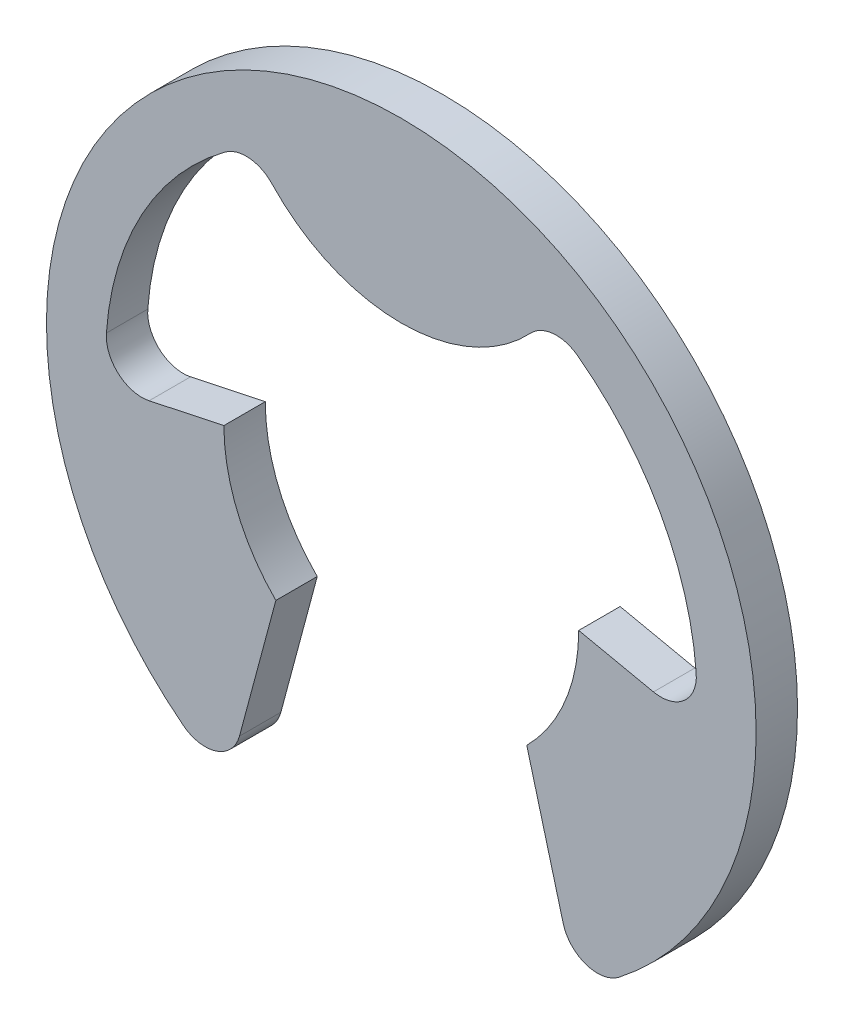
ISO-10303-21;
HEADER;
FILE_DESCRIPTION(('STEP AP214'),'2;1');
FILE_NAME('part.step','',(''),(''),'','','');
FILE_SCHEMA(('AUTOMOTIVE_DESIGN { 1 0 10303 214 1 1 1 1 }'));
ENDSEC;
DATA;
#1=APPLICATION_CONTEXT('core data for automotive mechanical design processes');
#2=APPLICATION_PROTOCOL_DEFINITION('international standard','automotive_design',2000,#1);
#3=PRODUCT_CONTEXT('',#1,'mechanical');
#4=PRODUCT('Part','Part','',(#3));
#5=PRODUCT_RELATED_PRODUCT_CATEGORY('part','',(#4));
#6=PRODUCT_DEFINITION_FORMATION('','',#4);
#7=PRODUCT_DEFINITION_CONTEXT('part definition',#1,'design');
#8=PRODUCT_DEFINITION('design','',#6,#7);
#9=PRODUCT_DEFINITION_SHAPE('','',#8);
#10=(LENGTH_UNIT() NAMED_UNIT(*) SI_UNIT(.MILLI.,.METRE.));
#11=(NAMED_UNIT(*) PLANE_ANGLE_UNIT() SI_UNIT($,.RADIAN.));
#12=(NAMED_UNIT(*) SI_UNIT($,.STERADIAN.) SOLID_ANGLE_UNIT());
#13=UNCERTAINTY_MEASURE_WITH_UNIT(LENGTH_MEASURE(1.E-05),#10,'distance_accuracy_value','');
#14=(GEOMETRIC_REPRESENTATION_CONTEXT(3) GLOBAL_UNCERTAINTY_ASSIGNED_CONTEXT((#13)) GLOBAL_UNIT_ASSIGNED_CONTEXT((#10,
#11,#12)) REPRESENTATION_CONTEXT('',''));
#15=CARTESIAN_POINT('',(0.,0.,0.));
#16=DIRECTION('',(0.,0.,1.));
#17=DIRECTION('',(1.,0.,0.));
#18=AXIS2_PLACEMENT_3D('',#15,#16,#17);
#19=CARTESIAN_POINT('',(0.,6.,-0.35));
#20=DIRECTION('',(0.,0.,1.));
#21=DIRECTION('',(1.,0.,0.));
#22=AXIS2_PLACEMENT_3D('',#19,#20,#21);
#23=PLANE('',#22);
#24=CARTESIAN_POINT('',(0.,0.,-0.35));
#25=DIRECTION('',(0.,0.,-1.));
#26=DIRECTION('',(-1.,0.,0.));
#27=AXIS2_PLACEMENT_3D('',#24,#25,#26);
#28=CIRCLE('',#27,5.);
#29=CARTESIAN_POINT('',(-2.9796909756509,4.01515151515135,-0.35));
#30=VERTEX_POINT('',#29);
#31=CARTESIAN_POINT('',(-4.98689720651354,0.361740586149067,-0.35));
#32=VERTEX_POINT('',#31);
#33=EDGE_CURVE('E204',#30,#32,#28,.F.);
#34=ORIENTED_EDGE('',*,*,#33,.T.);
#35=CARTESIAN_POINT('',(-4.388473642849,0.3182751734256,-0.35));
#36=DIRECTION('',(0.,0.,1.));
#37=DIRECTION('',(1.,0.,0.));
#38=AXIS2_PLACEMENT_3D('',#35,#36,#37);
#39=CIRCLE('',#38,0.6);
#40=CARTESIAN_POINT('',(-4.26372662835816,-0.268613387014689,-0.35));
#41=VERTEX_POINT('',#40);
#42=EDGE_CURVE('E206',#32,#41,#39,.T.);
#43=ORIENTED_EDGE('',*,*,#42,.T.);
#44=DIRECTION('',(0.978147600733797,0.207911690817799,0.));
#45=VECTOR('',#44,1.);
#46=CARTESIAN_POINT('',(-4.263726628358,-0.2686133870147,-0.35));
#47=LINE('',#46,#45);
#48=CARTESIAN_POINT('',(-3.,0.,-0.35));
#49=VERTEX_POINT('',#48);
#50=EDGE_CURVE('E153',#41,#49,#47,.T.);
#51=ORIENTED_EDGE('',*,*,#50,.T.);
#52=CARTESIAN_POINT('',(0.,0.,-0.35));
#53=DIRECTION('',(0.,0.,-1.));
#54=DIRECTION('',(-1.,0.,0.));
#55=AXIS2_PLACEMENT_3D('',#52,#53,#54);
#56=CIRCLE('',#55,3.);
#57=CARTESIAN_POINT('',(-2.12132034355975,-2.12132034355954,-0.35));
#58=VERTEX_POINT('',#57);
#59=EDGE_CURVE('E209',#49,#58,#56,.F.);
#60=ORIENTED_EDGE('',*,*,#59,.T.);
#61=DIRECTION('',(-0.258819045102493,-0.965925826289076,0.));
#62=VECTOR('',#61,1.);
#63=CARTESIAN_POINT('',(-2.12132034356,-2.12132034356,-0.35));
#64=LINE('',#63,#62);
#65=CARTESIAN_POINT('',(-2.73649723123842,-4.41719174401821,-0.35));
#66=VERTEX_POINT('',#65);
#67=EDGE_CURVE('E157',#58,#66,#64,.T.);
#68=ORIENTED_EDGE('',*,*,#67,.T.);
#69=CARTESIAN_POINT('',(-3.316052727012,-4.261900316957,-0.35));
#70=DIRECTION('',(0.,0.,-1.));
#71=DIRECTION('',(-1.,0.,0.));
#72=AXIS2_PLACEMENT_3D('',#69,#70,#71);
#73=CIRCLE('',#72,0.6);
#74=CARTESIAN_POINT('',(-3.68450303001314,-4.73544479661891,-0.35));
#75=VERTEX_POINT('',#74);
#76=EDGE_CURVE('E160',#75,#66,#73,.F.);
#77=ORIENTED_EDGE('',*,*,#76,.F.);
#78=CARTESIAN_POINT('',(0.,0.,-0.35));
#79=DIRECTION('',(0.,0.,-1.));
#80=DIRECTION('',(-1.,0.,0.));
#81=AXIS2_PLACEMENT_3D('',#78,#79,#80);
#82=CIRCLE('',#81,6.);
#83=CARTESIAN_POINT('',(3.68450303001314,-4.73544479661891,-0.35));
#84=VERTEX_POINT('',#83);
#85=EDGE_CURVE('E214',#84,#75,#82,.F.);
#86=ORIENTED_EDGE('',*,*,#85,.F.);
#87=CARTESIAN_POINT('',(3.316052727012,-4.261900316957,-0.35));
#88=DIRECTION('',(0.,0.,-1.));
#89=DIRECTION('',(-1.,0.,0.));
#90=AXIS2_PLACEMENT_3D('',#87,#88,#89);
#91=CIRCLE('',#90,0.6);
#92=CARTESIAN_POINT('',(2.73649723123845,-4.4171917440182,-0.35));
#93=VERTEX_POINT('',#92);
#94=EDGE_CURVE('E217',#93,#84,#91,.F.);
#95=ORIENTED_EDGE('',*,*,#94,.F.);
#96=DIRECTION('',(-0.258819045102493,0.965925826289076,0.));
#97=VECTOR('',#96,1.);
#98=CARTESIAN_POINT('',(2.12132034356,-2.12132034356,-0.35));
#99=LINE('',#98,#97);
#100=CARTESIAN_POINT('',(2.12132034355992,-2.12132034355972,-0.35));
#101=VERTEX_POINT('',#100);
#102=EDGE_CURVE('E161',#93,#101,#99,.T.);
#103=ORIENTED_EDGE('',*,*,#102,.T.);
#104=CARTESIAN_POINT('',(0.,0.,-0.35));
#105=DIRECTION('',(0.,0.,-1.));
#106=DIRECTION('',(-1.,0.,0.));
#107=AXIS2_PLACEMENT_3D('',#104,#105,#106);
#108=CIRCLE('',#107,3.);
#109=CARTESIAN_POINT('',(3.,0.,-0.35));
#110=VERTEX_POINT('',#109);
#111=EDGE_CURVE('E221',#101,#110,#108,.F.);
#112=ORIENTED_EDGE('',*,*,#111,.T.);
#113=DIRECTION('',(0.978147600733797,-0.207911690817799,0.));
#114=VECTOR('',#113,1.);
#115=CARTESIAN_POINT('',(4.263726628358,-0.2686133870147,-0.35));
#116=LINE('',#115,#114);
#117=CARTESIAN_POINT('',(4.26372662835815,-0.268613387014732,-0.35));
#118=VERTEX_POINT('',#117);
#119=EDGE_CURVE('E165',#110,#118,#116,.T.);
#120=ORIENTED_EDGE('',*,*,#119,.T.);
#121=CARTESIAN_POINT('',(4.388473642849,0.3182751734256,-0.35));
#122=DIRECTION('',(0.,0.,-1.));
#123=DIRECTION('',(-1.,0.,0.));
#124=AXIS2_PLACEMENT_3D('',#121,#122,#123);
#125=CIRCLE('',#124,0.6);
#126=CARTESIAN_POINT('',(4.98690186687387,0.361676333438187,-0.35));
#127=VERTEX_POINT('',#126);
#128=EDGE_CURVE('E133',#118,#127,#125,.F.);
#129=ORIENTED_EDGE('',*,*,#128,.T.);
#130=CARTESIAN_POINT('',(0.,0.,-0.35));
#131=DIRECTION('',(0.,0.,-1.));
#132=DIRECTION('',(-1.,0.,0.));
#133=AXIS2_PLACEMENT_3D('',#130,#131,#132);
#134=CIRCLE('',#133,5.);
#135=CARTESIAN_POINT('',(2.97969097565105,4.01515151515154,-0.35));
#136=VERTEX_POINT('',#135);
#137=EDGE_CURVE('E128',#127,#136,#134,.F.);
#138=ORIENTED_EDGE('',*,*,#137,.T.);
#139=CARTESIAN_POINT('',(2.622128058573,3.533333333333,-0.35));
#140=DIRECTION('',(0.,0.,-1.));
#141=DIRECTION('',(-1.,0.,0.));
#142=AXIS2_PLACEMENT_3D('',#139,#140,#141);
#143=CIRCLE('',#142,0.6);
#144=CARTESIAN_POINT('',(2.18510671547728,3.94444444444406,-0.35));
#145=VERTEX_POINT('',#144);
#146=EDGE_CURVE('E21',#136,#145,#143,.F.);
#147=ORIENTED_EDGE('',*,*,#146,.T.);
#148=CARTESIAN_POINT('',(0.,6.,-0.35));
#149=DIRECTION('',(0.,0.,-1.));
#150=DIRECTION('',(-1.,0.,0.));
#151=AXIS2_PLACEMENT_3D('',#148,#149,#150);
#152=CIRCLE('',#151,3.);
#153=CARTESIAN_POINT('',(-2.18510671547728,3.94444444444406,-0.35));
#154=VERTEX_POINT('',#153);
#155=EDGE_CURVE('E198',#154,#145,#152,.F.);
#156=ORIENTED_EDGE('',*,*,#155,.F.);
#157=CARTESIAN_POINT('',(-2.622128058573,3.533333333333,-0.35));
#158=DIRECTION('',(0.,0.,-1.));
#159=DIRECTION('',(-1.,0.,0.));
#160=AXIS2_PLACEMENT_3D('',#157,#158,#159);
#161=CIRCLE('',#160,0.6);
#162=EDGE_CURVE('E200',#154,#30,#161,.F.);
#163=ORIENTED_EDGE('',*,*,#162,.T.);
#164=EDGE_LOOP('',(#34,#43,#51,#60,#68,#77,#86,#95,#103,#112,#120,#129,#138,#147,#156,#163));
#165=FACE_BOUND('',#164,.T.);
#166=ADVANCED_FACE('F17',(#165),#23,.F.);
#167=CARTESIAN_POINT('',(2.622128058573,3.533333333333,0.35));
#168=DIRECTION('',(0.,0.,-1.));
#169=DIRECTION('',(-1.,0.,0.));
#170=AXIS2_PLACEMENT_3D('',#167,#168,#169);
#171=CYLINDRICAL_SURFACE('',#170,0.6);
#172=CARTESIAN_POINT('',(2.622128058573,3.533333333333,0.35));
#173=DIRECTION('',(0.,0.,-1.));
#174=DIRECTION('',(-1.,0.,0.));
#175=AXIS2_PLACEMENT_3D('',#172,#173,#174);
#176=CIRCLE('',#175,0.6);
#177=CARTESIAN_POINT('',(2.18510671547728,3.94444444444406,0.35));
#178=VERTEX_POINT('',#177);
#179=CARTESIAN_POINT('',(2.97969097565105,4.01515151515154,0.35));
#180=VERTEX_POINT('',#179);
#181=EDGE_CURVE('E196',#178,#180,#176,.T.);
#182=ORIENTED_EDGE('',*,*,#181,.F.);
#183=DIRECTION('',(0.,0.,-1.));
#184=VECTOR('',#183,1.);
#185=CARTESIAN_POINT('',(2.18510671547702,3.94444444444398,0.35));
#186=LINE('',#185,#184);
#187=EDGE_CURVE('E142',#145,#178,#186,.F.);
#188=ORIENTED_EDGE('',*,*,#187,.F.);
#189=ORIENTED_EDGE('',*,*,#146,.F.);
#190=DIRECTION('',(0.,0.,-1.));
#191=VECTOR('',#190,1.);
#192=CARTESIAN_POINT('',(2.9796909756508,4.01515151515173,0.35));
#193=LINE('',#192,#191);
#194=EDGE_CURVE('E137',#136,#180,#193,.F.);
#195=ORIENTED_EDGE('',*,*,#194,.T.);
#196=EDGE_LOOP('',(#182,#188,#189,#195));
#197=FACE_BOUND('',#196,.T.);
#198=ADVANCED_FACE('F139',(#197),#171,.F.);
#199=CARTESIAN_POINT('',(0.,0.,0.35));
#200=DIRECTION('',(0.,0.,-1.));
#201=DIRECTION('',(-1.,0.,0.));
#202=AXIS2_PLACEMENT_3D('',#199,#200,#201);
#203=CYLINDRICAL_SURFACE('',#202,5.);
#204=CARTESIAN_POINT('',(0.,0.,0.35));
#205=DIRECTION('',(0.,0.,-1.));
#206=DIRECTION('',(-1.,0.,0.));
#207=AXIS2_PLACEMENT_3D('',#204,#205,#206);
#208=CIRCLE('',#207,5.);
#209=CARTESIAN_POINT('',(4.98690186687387,0.361676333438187,0.35));
#210=VERTEX_POINT('',#209);
#211=EDGE_CURVE('E146',#180,#210,#208,.T.);
#212=ORIENTED_EDGE('',*,*,#211,.F.);
#213=ORIENTED_EDGE('',*,*,#194,.F.);
#214=ORIENTED_EDGE('',*,*,#137,.F.);
#215=DIRECTION('',(0.,0.,-1.));
#216=VECTOR('',#215,1.);
#217=CARTESIAN_POINT('',(4.98690186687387,0.361676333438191,0.35));
#218=LINE('',#217,#216);
#219=EDGE_CURVE('E148',#127,#210,#218,.F.);
#220=ORIENTED_EDGE('',*,*,#219,.T.);
#221=EDGE_LOOP('',(#212,#213,#214,#220));
#222=FACE_BOUND('',#221,.T.);
#223=ADVANCED_FACE('F144',(#222),#203,.F.);
#224=CARTESIAN_POINT('',(4.388473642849,0.3182751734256,0.35));
#225=DIRECTION('',(0.,0.,-1.));
#226=DIRECTION('',(-1.,0.,0.));
#227=AXIS2_PLACEMENT_3D('',#224,#225,#226);
#228=CYLINDRICAL_SURFACE('',#227,0.6);
#229=DIRECTION('',(0.,0.,1.));
#230=VECTOR('',#229,1.);
#231=CARTESIAN_POINT('',(4.263726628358,-0.2686133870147,0.35));
#232=LINE('',#231,#230);
#233=CARTESIAN_POINT('',(4.26372662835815,-0.268613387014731,0.35));
#234=VERTEX_POINT('',#233);
#235=EDGE_CURVE('E166',#118,#234,#232,.T.);
#236=ORIENTED_EDGE('',*,*,#235,.T.);
#237=CARTESIAN_POINT('',(4.388473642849,0.3182751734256,0.35));
#238=DIRECTION('',(0.,0.,1.));
#239=DIRECTION('',(1.,0.,0.));
#240=AXIS2_PLACEMENT_3D('',#237,#238,#239);
#241=CIRCLE('',#240,0.6);
#242=EDGE_CURVE('E193',#210,#234,#241,.F.);
#243=ORIENTED_EDGE('',*,*,#242,.F.);
#244=ORIENTED_EDGE('',*,*,#219,.F.);
#245=ORIENTED_EDGE('',*,*,#128,.F.);
#246=EDGE_LOOP('',(#236,#243,#244,#245));
#247=FACE_BOUND('',#246,.T.);
#248=ADVANCED_FACE('F321',(#247),#228,.F.);
#249=CARTESIAN_POINT('',(4.263726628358,-0.2686133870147,0.35));
#250=DIRECTION('',(-0.207911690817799,-0.978147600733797,0.));
#251=DIRECTION('',(0.978147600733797,-0.207911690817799,0.));
#252=AXIS2_PLACEMENT_3D('',#249,#250,#251);
#253=PLANE('',#252);
#254=DIRECTION('',(-0.978147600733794,0.207911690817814,0.));
#255=VECTOR('',#254,1.);
#256=CARTESIAN_POINT('',(4.263726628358,-0.2686133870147,0.35));
#257=LINE('',#256,#255);
#258=CARTESIAN_POINT('',(3.,0.,0.35));
#259=VERTEX_POINT('',#258);
#260=EDGE_CURVE('E192',#234,#259,#257,.T.);
#261=ORIENTED_EDGE('',*,*,#260,.F.);
#262=ORIENTED_EDGE('',*,*,#235,.F.);
#263=ORIENTED_EDGE('',*,*,#119,.F.);
#264=DIRECTION('',(0.,0.,-1.));
#265=VECTOR('',#264,1.);
#266=CARTESIAN_POINT('',(3.,0.,0.35));
#267=LINE('',#266,#265);
#268=EDGE_CURVE('E164',#110,#259,#267,.F.);
#269=ORIENTED_EDGE('',*,*,#268,.T.);
#270=EDGE_LOOP('',(#261,#262,#263,#269));
#271=FACE_BOUND('',#270,.T.);
#272=ADVANCED_FACE('F317',(#271),#253,.F.);
#273=CARTESIAN_POINT('',(0.,0.,0.35));
#274=DIRECTION('',(0.,0.,-1.));
#275=DIRECTION('',(-1.,0.,0.));
#276=AXIS2_PLACEMENT_3D('',#273,#274,#275);
#277=CYLINDRICAL_SURFACE('',#276,3.);
#278=CARTESIAN_POINT('',(0.,0.,0.35));
#279=DIRECTION('',(0.,0.,-1.));
#280=DIRECTION('',(-1.,0.,0.));
#281=AXIS2_PLACEMENT_3D('',#278,#279,#280);
#282=CIRCLE('',#281,3.);
#283=CARTESIAN_POINT('',(2.12132034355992,-2.12132034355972,0.35));
#284=VERTEX_POINT('',#283);
#285=EDGE_CURVE('E189',#259,#284,#282,.T.);
#286=ORIENTED_EDGE('',*,*,#285,.F.);
#287=ORIENTED_EDGE('',*,*,#268,.F.);
#288=ORIENTED_EDGE('',*,*,#111,.F.);
#289=DIRECTION('',(0.,0.,1.));
#290=VECTOR('',#289,1.);
#291=CARTESIAN_POINT('',(2.12132034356,-2.12132034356,0.35));
#292=LINE('',#291,#290);
#293=EDGE_CURVE('E163',#101,#284,#292,.T.);
#294=ORIENTED_EDGE('',*,*,#293,.T.);
#295=EDGE_LOOP('',(#286,#287,#288,#294));
#296=FACE_BOUND('',#295,.T.);
#297=ADVANCED_FACE('F313',(#296),#277,.F.);
#298=CARTESIAN_POINT('',(2.12132034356,-2.12132034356,0.35));
#299=DIRECTION('',(0.965925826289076,0.258819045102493,0.));
#300=DIRECTION('',(-0.258819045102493,0.965925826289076,0.));
#301=AXIS2_PLACEMENT_3D('',#298,#299,#300);
#302=PLANE('',#301);
#303=DIRECTION('',(0.258819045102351,-0.965925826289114,0.));
#304=VECTOR('',#303,1.);
#305=CARTESIAN_POINT('',(2.12132034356,-2.12132034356,0.35));
#306=LINE('',#305,#304);
#307=CARTESIAN_POINT('',(2.73649723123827,-4.41719174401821,0.35));
#308=VERTEX_POINT('',#307);
#309=EDGE_CURVE('E188',#284,#308,#306,.T.);
#310=ORIENTED_EDGE('',*,*,#309,.F.);
#311=ORIENTED_EDGE('',*,*,#293,.F.);
#312=ORIENTED_EDGE('',*,*,#102,.F.);
#313=DIRECTION('',(0.,0.,-1.));
#314=VECTOR('',#313,1.);
#315=CARTESIAN_POINT('',(2.73649723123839,-4.41719174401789,0.35));
#316=LINE('',#315,#314);
#317=EDGE_CURVE('E220',#308,#93,#316,.T.);
#318=ORIENTED_EDGE('',*,*,#317,.F.);
#319=EDGE_LOOP('',(#310,#311,#312,#318));
#320=FACE_BOUND('',#319,.T.);
#321=ADVANCED_FACE('F309',(#320),#302,.F.);
#322=CARTESIAN_POINT('',(3.316052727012,-4.261900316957,0.35));
#323=DIRECTION('',(0.,0.,-1.));
#324=DIRECTION('',(-1.,0.,0.));
#325=AXIS2_PLACEMENT_3D('',#322,#323,#324);
#326=CYLINDRICAL_SURFACE('',#325,0.6);
#327=ORIENTED_EDGE('',*,*,#317,.T.);
#328=ORIENTED_EDGE('',*,*,#94,.T.);
#329=DIRECTION('',(0.,0.,-1.));
#330=VECTOR('',#329,1.);
#331=CARTESIAN_POINT('',(3.68450303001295,-4.73544479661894,0.35));
#332=LINE('',#331,#330);
#333=CARTESIAN_POINT('',(3.68450303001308,-4.73544479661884,0.35));
#334=VERTEX_POINT('',#333);
#335=EDGE_CURVE('E216',#334,#84,#332,.T.);
#336=ORIENTED_EDGE('',*,*,#335,.F.);
#337=CARTESIAN_POINT('',(3.316052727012,-4.261900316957,0.35));
#338=DIRECTION('',(0.,0.,-1.));
#339=DIRECTION('',(-1.,0.,0.));
#340=AXIS2_PLACEMENT_3D('',#337,#338,#339);
#341=CIRCLE('',#340,0.6);
#342=EDGE_CURVE('E185',#308,#334,#341,.F.);
#343=ORIENTED_EDGE('',*,*,#342,.F.);
#344=EDGE_LOOP('',(#327,#328,#336,#343));
#345=FACE_BOUND('',#344,.T.);
#346=ADVANCED_FACE('F305',(#345),#326,.T.);
#347=CARTESIAN_POINT('',(0.,0.,0.35));
#348=DIRECTION('',(0.,0.,-1.));
#349=DIRECTION('',(-1.,0.,0.));
#350=AXIS2_PLACEMENT_3D('',#347,#348,#349);
#351=CYLINDRICAL_SURFACE('',#350,6.);
#352=DIRECTION('',(0.,0.,-1.));
#353=VECTOR('',#352,1.);
#354=CARTESIAN_POINT('',(-3.68450303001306,-4.73544479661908,0.35));
#355=LINE('',#354,#353);
#356=CARTESIAN_POINT('',(-3.68450303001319,-4.73544479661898,0.35));
#357=VERTEX_POINT('',#356);
#358=EDGE_CURVE('E213',#357,#75,#355,.T.);
#359=ORIENTED_EDGE('',*,*,#358,.F.);
#360=CARTESIAN_POINT('',(0.,0.,0.35));
#361=DIRECTION('',(0.,0.,-1.));
#362=DIRECTION('',(-1.,0.,0.));
#363=AXIS2_PLACEMENT_3D('',#360,#361,#362);
#364=CIRCLE('',#363,6.);
#365=EDGE_CURVE('E183',#334,#357,#364,.F.);
#366=ORIENTED_EDGE('',*,*,#365,.F.);
#367=ORIENTED_EDGE('',*,*,#335,.T.);
#368=ORIENTED_EDGE('',*,*,#85,.T.);
#369=EDGE_LOOP('',(#359,#366,#367,#368));
#370=FACE_BOUND('',#369,.T.);
#371=ADVANCED_FACE('F301',(#370),#351,.T.);
#372=CARTESIAN_POINT('',(-3.316052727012,-4.261900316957,0.35));
#373=DIRECTION('',(0.,0.,-1.));
#374=DIRECTION('',(-1.,0.,0.));
#375=AXIS2_PLACEMENT_3D('',#372,#373,#374);
#376=CYLINDRICAL_SURFACE('',#375,0.6);
#377=ORIENTED_EDGE('',*,*,#358,.T.);
#378=ORIENTED_EDGE('',*,*,#76,.T.);
#379=DIRECTION('',(0.,0.,1.));
#380=VECTOR('',#379,1.);
#381=CARTESIAN_POINT('',(-2.73649723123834,-4.41719174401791,0.35));
#382=LINE('',#381,#380);
#383=CARTESIAN_POINT('',(-2.73649723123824,-4.41719174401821,0.35));
#384=VERTEX_POINT('',#383);
#385=EDGE_CURVE('E159',#66,#384,#382,.T.);
#386=ORIENTED_EDGE('',*,*,#385,.T.);
#387=CARTESIAN_POINT('',(-3.316052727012,-4.261900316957,0.35));
#388=DIRECTION('',(0.,0.,-1.));
#389=DIRECTION('',(-1.,0.,0.));
#390=AXIS2_PLACEMENT_3D('',#387,#388,#389);
#391=CIRCLE('',#390,0.6);
#392=EDGE_CURVE('E180',#357,#384,#391,.F.);
#393=ORIENTED_EDGE('',*,*,#392,.F.);
#394=EDGE_LOOP('',(#377,#378,#386,#393));
#395=FACE_BOUND('',#394,.T.);
#396=ADVANCED_FACE('F297',(#395),#376,.T.);
#397=CARTESIAN_POINT('',(-2.12132034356,-2.12132034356,0.35));
#398=DIRECTION('',(-0.965925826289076,0.258819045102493,0.));
#399=DIRECTION('',(-0.258819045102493,-0.965925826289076,0.));
#400=AXIS2_PLACEMENT_3D('',#397,#398,#399);
#401=PLANE('',#400);
#402=DIRECTION('',(0.258819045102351,0.965925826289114,0.));
#403=VECTOR('',#402,1.);
#404=CARTESIAN_POINT('',(-2.736497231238,-4.417191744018,0.35));
#405=LINE('',#404,#403);
#406=CARTESIAN_POINT('',(-2.12132034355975,-2.12132034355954,0.35));
#407=VERTEX_POINT('',#406);
#408=EDGE_CURVE('E179',#384,#407,#405,.T.);
#409=ORIENTED_EDGE('',*,*,#408,.F.);
#410=ORIENTED_EDGE('',*,*,#385,.F.);
#411=ORIENTED_EDGE('',*,*,#67,.F.);
#412=DIRECTION('',(0.,0.,-1.));
#413=VECTOR('',#412,1.);
#414=CARTESIAN_POINT('',(-2.12132034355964,-2.12132034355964,0.35));
#415=LINE('',#414,#413);
#416=EDGE_CURVE('E156',#58,#407,#415,.F.);
#417=ORIENTED_EDGE('',*,*,#416,.T.);
#418=EDGE_LOOP('',(#409,#410,#411,#417));
#419=FACE_BOUND('',#418,.T.);
#420=ADVANCED_FACE('F293',(#419),#401,.F.);
#421=CARTESIAN_POINT('',(0.,0.,0.35));
#422=DIRECTION('',(0.,0.,-1.));
#423=DIRECTION('',(-1.,0.,0.));
#424=AXIS2_PLACEMENT_3D('',#421,#422,#423);
#425=CYLINDRICAL_SURFACE('',#424,3.);
#426=CARTESIAN_POINT('',(0.,0.,0.35));
#427=DIRECTION('',(0.,0.,-1.));
#428=DIRECTION('',(-1.,0.,0.));
#429=AXIS2_PLACEMENT_3D('',#426,#427,#428);
#430=CIRCLE('',#429,3.);
#431=CARTESIAN_POINT('',(-3.,0.,0.35));
#432=VERTEX_POINT('',#431);
#433=EDGE_CURVE('E176',#407,#432,#430,.T.);
#434=ORIENTED_EDGE('',*,*,#433,.F.);
#435=ORIENTED_EDGE('',*,*,#416,.F.);
#436=ORIENTED_EDGE('',*,*,#59,.F.);
#437=DIRECTION('',(0.,0.,1.));
#438=VECTOR('',#437,1.);
#439=CARTESIAN_POINT('',(-3.,0.,0.35));
#440=LINE('',#439,#438);
#441=EDGE_CURVE('E155',#49,#432,#440,.T.);
#442=ORIENTED_EDGE('',*,*,#441,.T.);
#443=EDGE_LOOP('',(#434,#435,#436,#442));
#444=FACE_BOUND('',#443,.T.);
#445=ADVANCED_FACE('F290',(#444),#425,.F.);
#446=CARTESIAN_POINT('',(-4.263726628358,-0.2686133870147,0.35));
#447=DIRECTION('',(0.207911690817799,-0.978147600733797,0.));
#448=DIRECTION('',(0.978147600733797,0.207911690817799,0.));
#449=AXIS2_PLACEMENT_3D('',#446,#447,#448);
#450=PLANE('',#449);
#451=DIRECTION('',(-0.978147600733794,-0.207911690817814,0.));
#452=VECTOR('',#451,1.);
#453=CARTESIAN_POINT('',(-3.,0.,0.35));
#454=LINE('',#453,#452);
#455=CARTESIAN_POINT('',(-4.26372662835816,-0.268613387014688,0.35));
#456=VERTEX_POINT('',#455);
#457=EDGE_CURVE('E175',#432,#456,#454,.T.);
#458=ORIENTED_EDGE('',*,*,#457,.F.);
#459=ORIENTED_EDGE('',*,*,#441,.F.);
#460=ORIENTED_EDGE('',*,*,#50,.F.);
#461=DIRECTION('',(0.,0.,-1.));
#462=VECTOR('',#461,1.);
#463=CARTESIAN_POINT('',(-4.26372662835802,-0.268613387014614,0.35));
#464=LINE('',#463,#462);
#465=EDGE_CURVE('E208',#41,#456,#464,.F.);
#466=ORIENTED_EDGE('',*,*,#465,.T.);
#467=EDGE_LOOP('',(#458,#459,#460,#466));
#468=FACE_BOUND('',#467,.T.);
#469=ADVANCED_FACE('F261',(#468),#450,.F.);
#470=CARTESIAN_POINT('',(-4.388473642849,0.3182751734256,0.35));
#471=DIRECTION('',(0.,0.,-1.));
#472=DIRECTION('',(-1.,0.,0.));
#473=AXIS2_PLACEMENT_3D('',#470,#471,#472);
#474=CYLINDRICAL_SURFACE('',#473,0.6);
#475=ORIENTED_EDGE('',*,*,#42,.F.);
#476=DIRECTION('',(0.,0.,-1.));
#477=VECTOR('',#476,1.);
#478=CARTESIAN_POINT('',(-4.98689720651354,0.361740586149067,0.35));
#479=LINE('',#478,#477);
#480=CARTESIAN_POINT('',(-4.98689720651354,0.361740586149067,0.35));
#481=VERTEX_POINT('',#480);
#482=EDGE_CURVE('E203',#32,#481,#479,.F.);
#483=ORIENTED_EDGE('',*,*,#482,.T.);
#484=CARTESIAN_POINT('',(-4.388473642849,0.3182751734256,0.35));
#485=DIRECTION('',(0.,0.,-1.));
#486=DIRECTION('',(-1.,0.,0.));
#487=AXIS2_PLACEMENT_3D('',#484,#485,#486);
#488=CIRCLE('',#487,0.6);
#489=EDGE_CURVE('E173',#456,#481,#488,.T.);
#490=ORIENTED_EDGE('',*,*,#489,.F.);
#491=ORIENTED_EDGE('',*,*,#465,.F.);
#492=EDGE_LOOP('',(#475,#483,#490,#491));
#493=FACE_BOUND('',#492,.T.);
#494=ADVANCED_FACE('F266',(#493),#474,.F.);
#495=CARTESIAN_POINT('',(0.,0.,0.35));
#496=DIRECTION('',(0.,0.,-1.));
#497=DIRECTION('',(-1.,0.,0.));
#498=AXIS2_PLACEMENT_3D('',#495,#496,#497);
#499=CYLINDRICAL_SURFACE('',#498,5.);
#500=CARTESIAN_POINT('',(0.,0.,0.35));
#501=DIRECTION('',(0.,0.,-1.));
#502=DIRECTION('',(-1.,0.,0.));
#503=AXIS2_PLACEMENT_3D('',#500,#501,#502);
#504=CIRCLE('',#503,5.);
#505=CARTESIAN_POINT('',(-2.9796909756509,4.01515151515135,0.35));
#506=VERTEX_POINT('',#505);
#507=EDGE_CURVE('E170',#481,#506,#504,.T.);
#508=ORIENTED_EDGE('',*,*,#507,.F.);
#509=ORIENTED_EDGE('',*,*,#482,.F.);
#510=ORIENTED_EDGE('',*,*,#33,.F.);
#511=DIRECTION('',(0.,0.,-1.));
#512=VECTOR('',#511,1.);
#513=CARTESIAN_POINT('',(-2.97969097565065,4.01515151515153,0.35));
#514=LINE('',#513,#512);
#515=EDGE_CURVE('E202',#30,#506,#514,.F.);
#516=ORIENTED_EDGE('',*,*,#515,.T.);
#517=EDGE_LOOP('',(#508,#509,#510,#516));
#518=FACE_BOUND('',#517,.T.);
#519=ADVANCED_FACE('F271',(#518),#499,.F.);
#520=CARTESIAN_POINT('',(-2.622128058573,3.533333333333,0.35));
#521=DIRECTION('',(0.,0.,-1.));
#522=DIRECTION('',(-1.,0.,0.));
#523=AXIS2_PLACEMENT_3D('',#520,#521,#522);
#524=CYLINDRICAL_SURFACE('',#523,0.6);
#525=CARTESIAN_POINT('',(-2.622128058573,3.533333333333,0.35));
#526=DIRECTION('',(0.,0.,-1.));
#527=DIRECTION('',(-1.,0.,0.));
#528=AXIS2_PLACEMENT_3D('',#525,#526,#527);
#529=CIRCLE('',#528,0.6);
#530=CARTESIAN_POINT('',(-2.18510671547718,3.94444444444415,0.35));
#531=VERTEX_POINT('',#530);
#532=EDGE_CURVE('E27',#506,#531,#529,.T.);
#533=ORIENTED_EDGE('',*,*,#532,.F.);
#534=ORIENTED_EDGE('',*,*,#515,.F.);
#535=ORIENTED_EDGE('',*,*,#162,.F.);
#536=DIRECTION('',(0.,0.,-1.));
#537=VECTOR('',#536,1.);
#538=CARTESIAN_POINT('',(-2.18510671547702,3.94444444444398,0.35));
#539=LINE('',#538,#537);
#540=EDGE_CURVE('E36',#531,#154,#539,.T.);
#541=ORIENTED_EDGE('',*,*,#540,.F.);
#542=EDGE_LOOP('',(#533,#534,#535,#541));
#543=FACE_BOUND('',#542,.T.);
#544=ADVANCED_FACE('F273',(#543),#524,.F.);
#545=CARTESIAN_POINT('',(0.,6.,0.35));
#546=DIRECTION('',(0.,0.,-1.));
#547=DIRECTION('',(-1.,0.,0.));
#548=AXIS2_PLACEMENT_3D('',#545,#546,#547);
#549=CYLINDRICAL_SURFACE('',#548,3.);
#550=ORIENTED_EDGE('',*,*,#540,.T.);
#551=ORIENTED_EDGE('',*,*,#155,.T.);
#552=ORIENTED_EDGE('',*,*,#187,.T.);
#553=CARTESIAN_POINT('',(0.,6.,0.35));
#554=DIRECTION('',(0.,0.,-1.));
#555=DIRECTION('',(-1.,0.,0.));
#556=AXIS2_PLACEMENT_3D('',#553,#554,#555);
#557=CIRCLE('',#556,3.);
#558=EDGE_CURVE('E11',#531,#178,#557,.F.);
#559=ORIENTED_EDGE('',*,*,#558,.F.);
#560=EDGE_LOOP('',(#550,#551,#552,#559));
#561=FACE_BOUND('',#560,.T.);
#562=ADVANCED_FACE('F275',(#561),#549,.T.);
#563=CARTESIAN_POINT('',(0.,6.,0.35));
#564=DIRECTION('',(0.,0.,1.));
#565=DIRECTION('',(1.,0.,0.));
#566=AXIS2_PLACEMENT_3D('',#563,#564,#565);
#567=PLANE('',#566);
#568=ORIENTED_EDGE('',*,*,#532,.T.);
#569=ORIENTED_EDGE('',*,*,#558,.T.);
#570=ORIENTED_EDGE('',*,*,#181,.T.);
#571=ORIENTED_EDGE('',*,*,#211,.T.);
#572=ORIENTED_EDGE('',*,*,#242,.T.);
#573=ORIENTED_EDGE('',*,*,#260,.T.);
#574=ORIENTED_EDGE('',*,*,#285,.T.);
#575=ORIENTED_EDGE('',*,*,#309,.T.);
#576=ORIENTED_EDGE('',*,*,#342,.T.);
#577=ORIENTED_EDGE('',*,*,#365,.T.);
#578=ORIENTED_EDGE('',*,*,#392,.T.);
#579=ORIENTED_EDGE('',*,*,#408,.T.);
#580=ORIENTED_EDGE('',*,*,#433,.T.);
#581=ORIENTED_EDGE('',*,*,#457,.T.);
#582=ORIENTED_EDGE('',*,*,#489,.T.);
#583=ORIENTED_EDGE('',*,*,#507,.T.);
#584=EDGE_LOOP('',(#568,#569,#570,#571,#572,#573,#574,#575,#576,#577,#578,#579,#580,#581,#582,#583));
#585=FACE_BOUND('',#584,.T.);
#586=ADVANCED_FACE('F19',(#585),#567,.T.);
#587=CLOSED_SHELL('',(#166,#198,#223,#248,#272,#297,#321,#346,#371,#396,#420,#445,#469,#494,
#519,#544,#562,#586));
#588=MANIFOLD_SOLID_BREP('B1',#587);
#589=ADVANCED_BREP_SHAPE_REPRESENTATION('',(#18,#588),#14);
#590=SHAPE_DEFINITION_REPRESENTATION(#9,#589);
ENDSEC;
END-ISO-10303-21;
